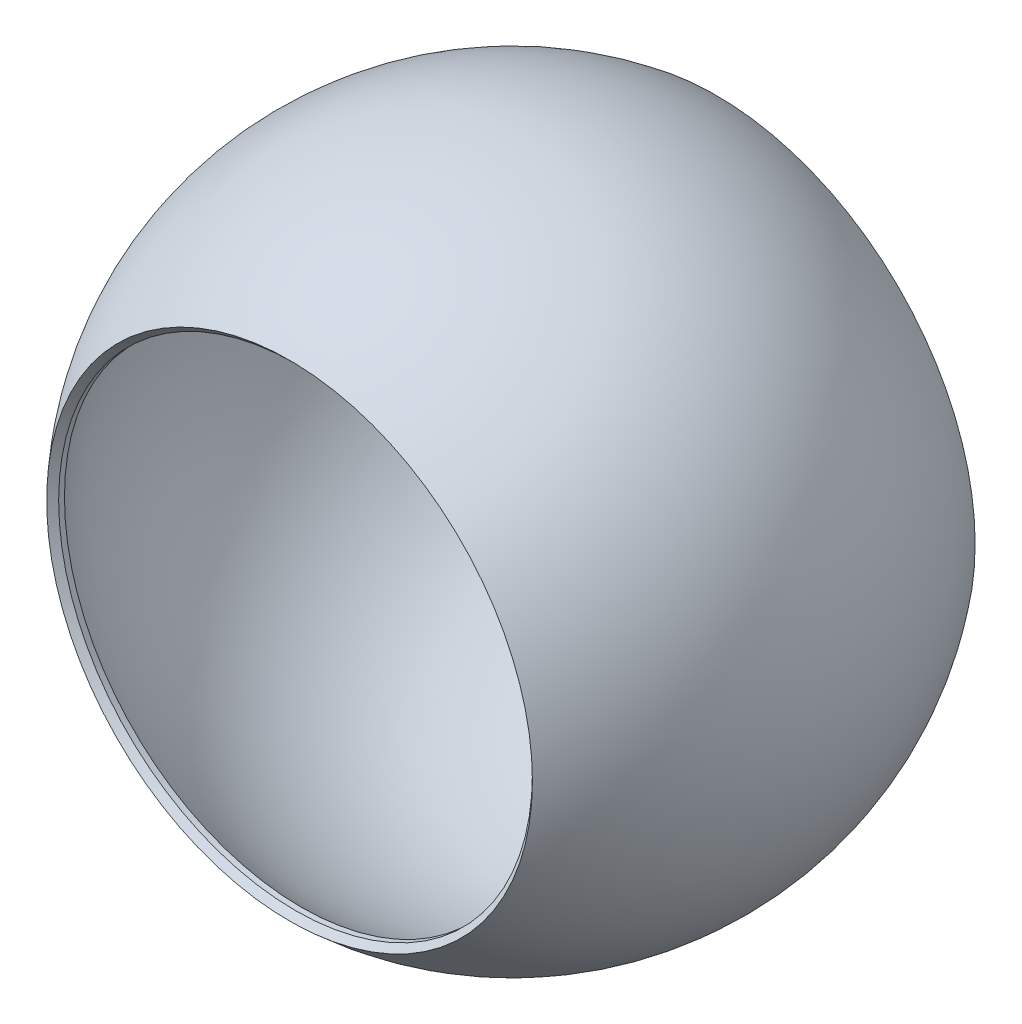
ISO-10303-21;
HEADER;
FILE_DESCRIPTION(('STEP AP214'),'2;1');
FILE_NAME('part.step','',(''),(''),'','','');
FILE_SCHEMA(('AUTOMOTIVE_DESIGN { 1 0 10303 214 1 1 1 1 }'));
ENDSEC;
DATA;
#1=APPLICATION_CONTEXT('core data for automotive mechanical design processes');
#2=APPLICATION_PROTOCOL_DEFINITION('international standard','automotive_design',2000,#1);
#3=PRODUCT_CONTEXT('',#1,'mechanical');
#4=PRODUCT('Part','Part','',(#3));
#5=PRODUCT_RELATED_PRODUCT_CATEGORY('part','',(#4));
#6=PRODUCT_DEFINITION_FORMATION('','',#4);
#7=PRODUCT_DEFINITION_CONTEXT('part definition',#1,'design');
#8=PRODUCT_DEFINITION('design','',#6,#7);
#9=PRODUCT_DEFINITION_SHAPE('','',#8);
#10=(LENGTH_UNIT() NAMED_UNIT(*) SI_UNIT(.MILLI.,.METRE.));
#11=(NAMED_UNIT(*) PLANE_ANGLE_UNIT() SI_UNIT($,.RADIAN.));
#12=(NAMED_UNIT(*) SI_UNIT($,.STERADIAN.) SOLID_ANGLE_UNIT());
#13=UNCERTAINTY_MEASURE_WITH_UNIT(LENGTH_MEASURE(1.E-05),#10,'distance_accuracy_value','');
#14=(GEOMETRIC_REPRESENTATION_CONTEXT(3) GLOBAL_UNCERTAINTY_ASSIGNED_CONTEXT((#13)) GLOBAL_UNIT_ASSIGNED_CONTEXT((#10,
#11,#12)) REPRESENTATION_CONTEXT('',''));
#15=CARTESIAN_POINT('',(0.,0.,0.));
#16=DIRECTION('',(0.,0.,1.));
#17=DIRECTION('',(1.,0.,0.));
#18=AXIS2_PLACEMENT_3D('',#15,#16,#17);
#19=CARTESIAN_POINT('',(0.,0.,0.));
#20=DIRECTION('',(0.,1.,0.));
#21=DIRECTION('',(-1.,0.,0.));
#22=AXIS2_PLACEMENT_3D('',#19,#20,#21);
#23=SPHERICAL_SURFACE('',#22,77.);
#24=CARTESIAN_POINT('',(0.,0.,0.));
#25=DIRECTION('',(0.,0.,1.));
#26=DIRECTION('',(1.,0.,0.));
#27=AXIS2_PLACEMENT_3D('',#24,#25,#26);
#28=SPHERICAL_SURFACE('',#27,77.);
#29=CARTESIAN_POINT('',(0.,0.,-46.9893604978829));
#30=DIRECTION('',(0.,0.,1.));
#31=DIRECTION('',(1.,0.,0.));
#32=AXIS2_PLACEMENT_3D('',#29,#30,#31);
#33=CIRCLE('',#32,61.);
#34=CARTESIAN_POINT('',(61.,0.,-46.9893604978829));
#35=VERTEX_POINT('',#34);
#36=EDGE_CURVE('E53',#35,#35,#33,.T.);
#37=ORIENTED_EDGE('',*,*,#36,.F.);
#38=EDGE_LOOP('',(#37));
#39=FACE_BOUND('',#38,.T.);
#40=CARTESIAN_POINT('',(0.,0.,51.2127913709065));
#41=DIRECTION('',(0.,0.,-1.));
#42=DIRECTION('',(-1.,0.,0.));
#43=AXIS2_PLACEMENT_3D('',#40,#41,#42);
#44=CIRCLE('',#43,57.5);
#45=CARTESIAN_POINT('',(-57.5,0.,51.2127913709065));
#46=VERTEX_POINT('',#45);
#47=EDGE_CURVE('E50',#46,#46,#44,.F.);
#48=ORIENTED_EDGE('',*,*,#47,.T.);
#49=EDGE_LOOP('',(#48));
#50=FACE_BOUND('',#49,.T.);
#51=ADVANCED_FACE('F30',(#39,#50),#28,.F.);
#52=CARTESIAN_POINT('',(0.,0.,80.));
#53=DIRECTION('',(0.,0.,-1.));
#54=DIRECTION('',(-1.,0.,0.));
#55=AXIS2_PLACEMENT_3D('',#52,#53,#54);
#56=CYLINDRICAL_SURFACE('',#55,57.5);
#57=CARTESIAN_POINT('',(0.,0.,52.6214886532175));
#58=DIRECTION('',(0.,0.,1.));
#59=DIRECTION('',(1.,0.,0.));
#60=AXIS2_PLACEMENT_3D('',#57,#58,#59);
#61=CIRCLE('',#60,57.5);
#62=CARTESIAN_POINT('',(57.5,0.,52.6214886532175));
#63=VERTEX_POINT('',#62);
#64=EDGE_CURVE('E10',#63,#63,#61,.T.);
#65=ORIENTED_EDGE('',*,*,#64,.T.);
#66=EDGE_LOOP('',(#65));
#67=FACE_BOUND('',#66,.T.);
#68=ORIENTED_EDGE('',*,*,#47,.F.);
#69=EDGE_LOOP('',(#68));
#70=FACE_BOUND('',#69,.T.);
#71=ADVANCED_FACE('F61',(#67,#70),#56,.F.);
#72=CARTESIAN_POINT('',(0.,0.,0.));
#73=DIRECTION('',(0.,1.,0.));
#74=DIRECTION('',(1.,0.,0.));
#75=AXIS2_PLACEMENT_3D('',#72,#73,#74);
#76=SPHERICAL_SURFACE('',#75,80.);
#77=CARTESIAN_POINT('',(0.,0.,0.));
#78=DIRECTION('',(0.,0.,1.));
#79=DIRECTION('',(1.,0.,0.));
#80=AXIS2_PLACEMENT_3D('',#77,#78,#79);
#81=SPHERICAL_SURFACE('',#80,80.);
#82=CARTESIAN_POINT('',(0.,0.,-49.4778239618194));
#83=DIRECTION('',(0.,0.,1.));
#84=DIRECTION('',(1.,0.,0.));
#85=AXIS2_PLACEMENT_3D('',#82,#83,#84);
#86=CIRCLE('',#85,62.8644966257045);
#87=CARTESIAN_POINT('',(62.8644966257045,0.,-49.4778239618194));
#88=VERTEX_POINT('',#87);
#89=EDGE_CURVE('E37',#88,#88,#86,.T.);
#90=ORIENTED_EDGE('',*,*,#89,.T.);
#91=EDGE_LOOP('',(#90));
#92=FACE_BOUND('',#91,.T.);
#93=CARTESIAN_POINT('',(0.,0.,54.0766715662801));
#94=DIRECTION('',(0.,0.,-1.));
#95=DIRECTION('',(-1.,0.,0.));
#96=AXIS2_PLACEMENT_3D('',#93,#94,#95);
#97=CIRCLE('',#96,58.9551829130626);
#98=CARTESIAN_POINT('',(58.9551829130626,0.,54.0766715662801));
#99=VERTEX_POINT('',#98);
#100=EDGE_CURVE('E41',#99,#99,#97,.T.);
#101=ORIENTED_EDGE('',*,*,#100,.T.);
#102=EDGE_LOOP('',(#101));
#103=FACE_BOUND('',#102,.T.);
#104=ADVANCED_FACE('F66',(#92,#103),#81,.T.);
#105=CARTESIAN_POINT('',(0.,0.,-80.));
#106=DIRECTION('',(0.,0.,1.));
#107=DIRECTION('',(1.,0.,0.));
#108=AXIS2_PLACEMENT_3D('',#105,#106,#107);
#109=CYLINDRICAL_SURFACE('',#108,61.);
#110=CARTESIAN_POINT('',(0.,0.,-49.6306250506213));
#111=DIRECTION('',(0.,0.,-1.));
#112=DIRECTION('',(-1.,0.,0.));
#113=AXIS2_PLACEMENT_3D('',#110,#111,#112);
#114=CIRCLE('',#113,61.);
#115=CARTESIAN_POINT('',(-61.,0.,-49.6306250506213));
#116=VERTEX_POINT('',#115);
#117=EDGE_CURVE('E45',#116,#116,#114,.T.);
#118=ORIENTED_EDGE('',*,*,#117,.T.);
#119=EDGE_LOOP('',(#118));
#120=FACE_BOUND('',#119,.T.);
#121=ORIENTED_EDGE('',*,*,#36,.T.);
#122=EDGE_LOOP('',(#121));
#123=FACE_BOUND('',#122,.T.);
#124=ADVANCED_FACE('F57',(#120,#123),#109,.F.);
#125=CARTESIAN_POINT('',(0.,0.,-49.6306250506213));
#126=DIRECTION('',(0.,0.,1.));
#127=DIRECTION('',(1.,0.,0.));
#128=AXIS2_PLACEMENT_3D('',#125,#126,#127);
#129=CONICAL_SURFACE('',#128,61.,1.48902606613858);
#130=ORIENTED_EDGE('',*,*,#89,.F.);
#131=EDGE_LOOP('',(#130));
#132=FACE_BOUND('',#131,.T.);
#133=ORIENTED_EDGE('',*,*,#117,.F.);
#134=EDGE_LOOP('',(#133));
#135=FACE_BOUND('',#134,.T.);
#136=ADVANCED_FACE('F73',(#132,#135),#129,.T.);
#137=CARTESIAN_POINT('',(0.,0.,54.0766715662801));
#138=DIRECTION('',(0.,0.,1.));
#139=DIRECTION('',(1.,0.,0.));
#140=AXIS2_PLACEMENT_3D('',#137,#138,#139);
#141=CONICAL_SURFACE('',#140,58.9551829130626,0.785398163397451);
#142=CARTESIAN_POINT('',(57.5,0.,52.6214886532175));
#143=CARTESIAN_POINT('',(57.5151581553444,0.,52.6366468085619));
#144=CARTESIAN_POINT('',(57.5303163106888,0.,52.6518049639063));
#145=CARTESIAN_POINT('',(57.5606326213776,0.,52.6821212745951));
#146=CARTESIAN_POINT('',(57.575790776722,0.,52.6972794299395));
#147=CARTESIAN_POINT('',(57.6061070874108,0.,52.7275957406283));
#148=CARTESIAN_POINT('',(57.6212652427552,0.,52.7427538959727));
#149=CARTESIAN_POINT('',(57.651581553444,0.,52.7730702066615));
#150=CARTESIAN_POINT('',(57.6667397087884,0.,52.7882283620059));
#151=CARTESIAN_POINT('',(57.6970560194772,0.,52.8185446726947));
#152=CARTESIAN_POINT('',(57.7122141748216,0.,52.8337028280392));
#153=CARTESIAN_POINT('',(57.7425304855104,0.,52.8640191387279));
#154=CARTESIAN_POINT('',(57.7576886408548,0.,52.8791772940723));
#155=CARTESIAN_POINT('',(57.7880049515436,0.,52.9094936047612));
#156=CARTESIAN_POINT('',(57.803163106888,0.,52.9246517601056));
#157=CARTESIAN_POINT('',(57.8334794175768,0.,52.9549680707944));
#158=CARTESIAN_POINT('',(57.8486375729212,0.,52.9701262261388));
#159=CARTESIAN_POINT('',(57.8789538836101,0.,53.0004425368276));
#160=CARTESIAN_POINT('',(57.8941120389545,0.,53.015600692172));
#161=CARTESIAN_POINT('',(57.9244283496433,0.,53.0459170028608));
#162=CARTESIAN_POINT('',(57.9395865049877,0.,53.0610751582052));
#163=CARTESIAN_POINT('',(57.9699028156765,0.,53.091391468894));
#164=CARTESIAN_POINT('',(57.9850609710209,0.,53.1065496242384));
#165=CARTESIAN_POINT('',(58.0153772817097,0.,53.1368659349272));
#166=CARTESIAN_POINT('',(58.0305354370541,0.,53.1520240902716));
#167=CARTESIAN_POINT('',(58.0608517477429,0.,53.1823404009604));
#168=CARTESIAN_POINT('',(58.0760099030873,0.,53.1974985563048));
#169=CARTESIAN_POINT('',(58.1063262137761,0.,53.2278148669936));
#170=CARTESIAN_POINT('',(58.1214843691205,0.,53.242973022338));
#171=CARTESIAN_POINT('',(58.1518006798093,0.,53.2732893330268));
#172=CARTESIAN_POINT('',(58.1669588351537,0.,53.2884474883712));
#173=CARTESIAN_POINT('',(58.1972751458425,0.,53.31876379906));
#174=CARTESIAN_POINT('',(58.2124333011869,0.,53.3339219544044));
#175=CARTESIAN_POINT('',(58.2427496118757,0.,53.3642382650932));
#176=CARTESIAN_POINT('',(58.2579077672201,0.,53.3793964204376));
#177=CARTESIAN_POINT('',(58.2882240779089,0.,53.4097127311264));
#178=CARTESIAN_POINT('',(58.3033822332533,0.,53.4248708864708));
#179=CARTESIAN_POINT('',(58.3336985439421,0.,53.4551871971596));
#180=CARTESIAN_POINT('',(58.3488566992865,0.,53.470345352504));
#181=CARTESIAN_POINT('',(58.3791730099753,0.,53.5006616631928));
#182=CARTESIAN_POINT('',(58.3943311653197,0.,53.5158198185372));
#183=CARTESIAN_POINT('',(58.4246474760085,0.,53.546136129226));
#184=CARTESIAN_POINT('',(58.4398056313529,0.,53.5612942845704));
#185=CARTESIAN_POINT('',(58.4701219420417,0.,53.5916105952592));
#186=CARTESIAN_POINT('',(58.4852800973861,0.,53.6067687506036));
#187=CARTESIAN_POINT('',(58.5155964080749,0.,53.6370850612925));
#188=CARTESIAN_POINT('',(58.5307545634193,0.,53.6522432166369));
#189=CARTESIAN_POINT('',(58.5610708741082,0.,53.6825595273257));
#190=CARTESIAN_POINT('',(58.5762290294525,0.,53.6977176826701));
#191=CARTESIAN_POINT('',(58.6065453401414,0.,53.7280339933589));
#192=CARTESIAN_POINT('',(58.6217034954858,0.,53.7431921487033));
#193=CARTESIAN_POINT('',(58.6520198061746,0.,53.7735084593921));
#194=CARTESIAN_POINT('',(58.667177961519,0.,53.7886666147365));
#195=CARTESIAN_POINT('',(58.6974942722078,0.,53.8189829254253));
#196=CARTESIAN_POINT('',(58.7126524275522,0.,53.8341410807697));
#197=CARTESIAN_POINT('',(58.742968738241,0.,53.8644573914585));
#198=CARTESIAN_POINT('',(58.7581268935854,0.,53.8796155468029));
#199=CARTESIAN_POINT('',(58.7884432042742,0.,53.9099318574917));
#200=CARTESIAN_POINT('',(58.8036013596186,0.,53.9250900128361));
#201=CARTESIAN_POINT('',(58.8339176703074,0.,53.9554063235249));
#202=CARTESIAN_POINT('',(58.8490758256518,0.,53.9705644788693));
#203=CARTESIAN_POINT('',(58.8793921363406,0.,54.0008807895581));
#204=CARTESIAN_POINT('',(58.894550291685,0.,54.0160389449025));
#205=CARTESIAN_POINT('',(58.9248666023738,0.,54.0463552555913));
#206=CARTESIAN_POINT('',(58.9400247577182,0.,54.0615134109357));
#207=CARTESIAN_POINT('',(58.9551829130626,0.,54.0766715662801));
#208=B_SPLINE_CURVE_WITH_KNOTS('',3,(#142,#143,#144,#145,#146,#147,#148,#149,#150,#151,#152,
#153,#154,#155,#156,#157,#158,#159,#160,#161,#162,#163,#164,#165,#166,#167,#168,#169,#170,#171,
#172,#173,#174,#175,#176,#177,#178,#179,#180,#181,#182,#183,#184,#185,#186,#187,#188,#189,#190,
#191,#192,#193,#194,#195,#196,#197,#198,#199,#200,#201,#202,#203,#204,#205,#206,#207),
.UNSPECIFIED.,.F.,.F.,(4,2,2,2,2,2,2,2,2,2,2,2,2,2,2,2,2,2,2,2,2,2,2,2,2,2,2,2,2,2,2,2,4),(0.,
0.0643106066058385,0.128621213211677,0.19293181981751,0.257242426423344,0.321553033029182,
0.385863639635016,0.45017424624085,0.514484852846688,0.578795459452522,0.643106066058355,
0.707416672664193,0.771727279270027,0.83603788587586,0.900348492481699,0.964659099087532,
1.02896970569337,1.0932803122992,1.15759091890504,1.22190152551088,1.28621213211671,
1.35052273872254,1.41483334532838,1.47914395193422,1.54345455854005,1.60776516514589,
1.67207577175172,1.73638637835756,1.80069698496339,1.86500759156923,1.92931819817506,
1.9936288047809,2.05793941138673),.UNSPECIFIED.);
#209=EDGE_CURVE('BSEAM32',#63,#99,#208,.T.);
#210=ORIENTED_EDGE('',*,*,#64,.F.);
#211=ORIENTED_EDGE('',*,*,#100,.F.);
#212=ORIENTED_EDGE('',*,*,#209,.T.);
#213=ORIENTED_EDGE('',*,*,#209,.F.);
#214=EDGE_LOOP('',(#210,#212,#211,#213));
#215=FACE_BOUND('',#214,.T.);
#216=ADVANCED_FACE('F32',(#215),#141,.F.);
#217=CLOSED_SHELL('',(#51,#71,#104,#124,#136,#216));
#218=MANIFOLD_SOLID_BREP('B2',#217);
#219=ADVANCED_BREP_SHAPE_REPRESENTATION('',(#18,#218),#14);
#220=SHAPE_DEFINITION_REPRESENTATION(#9,#219);
ENDSEC;
END-ISO-10303-21;
